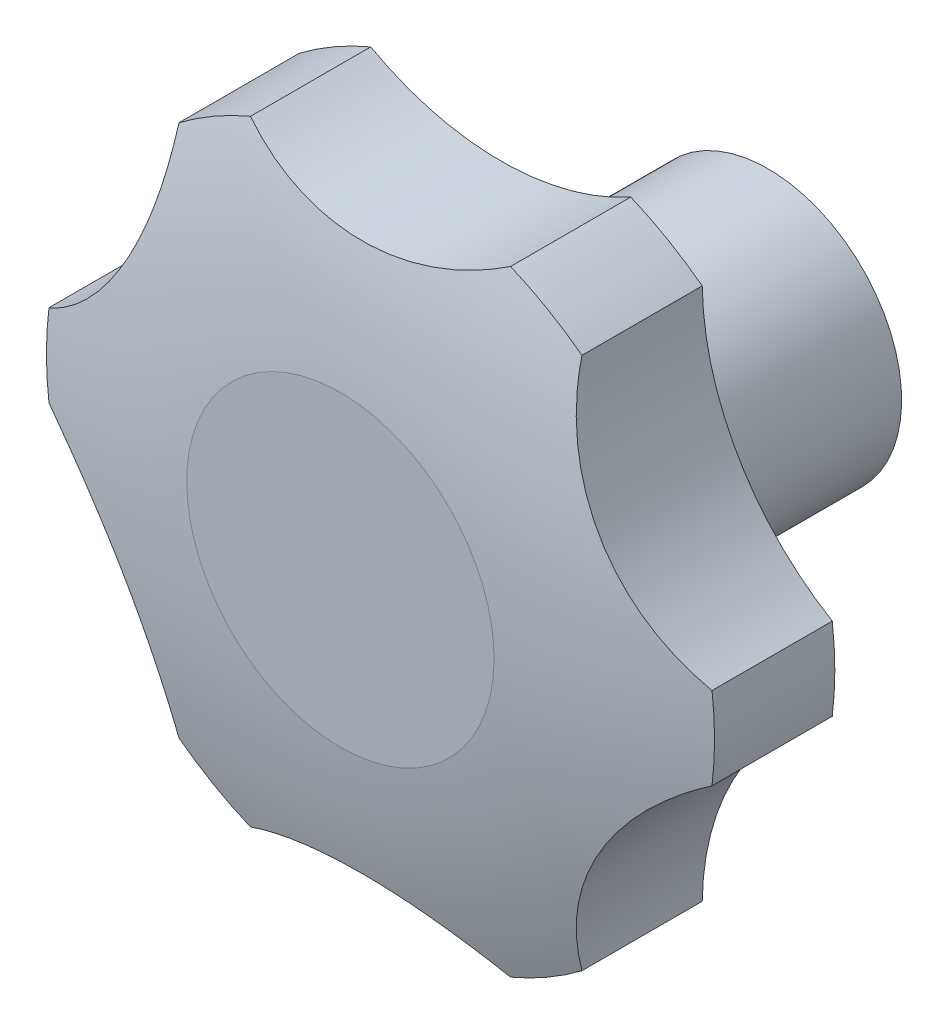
ISO-10303-21;
HEADER;
FILE_DESCRIPTION(('STEP AP214'),'2;1');
FILE_NAME('part.step','',(''),(''),'','','');
FILE_SCHEMA(('AUTOMOTIVE_DESIGN { 1 0 10303 214 1 1 1 1 }'));
ENDSEC;
DATA;
#1=APPLICATION_CONTEXT('core data for automotive mechanical design processes');
#2=APPLICATION_PROTOCOL_DEFINITION('international standard','automotive_design',2000,#1);
#3=PRODUCT_CONTEXT('',#1,'mechanical');
#4=PRODUCT('Part','Part','',(#3));
#5=PRODUCT_RELATED_PRODUCT_CATEGORY('part','',(#4));
#6=PRODUCT_DEFINITION_FORMATION('','',#4);
#7=PRODUCT_DEFINITION_CONTEXT('part definition',#1,'design');
#8=PRODUCT_DEFINITION('design','',#6,#7);
#9=PRODUCT_DEFINITION_SHAPE('','',#8);
#10=(LENGTH_UNIT() NAMED_UNIT(*) SI_UNIT(.MILLI.,.METRE.));
#11=(NAMED_UNIT(*) PLANE_ANGLE_UNIT() SI_UNIT($,.RADIAN.));
#12=(NAMED_UNIT(*) SI_UNIT($,.STERADIAN.) SOLID_ANGLE_UNIT());
#13=UNCERTAINTY_MEASURE_WITH_UNIT(LENGTH_MEASURE(1.E-05),#10,'distance_accuracy_value','');
#14=(GEOMETRIC_REPRESENTATION_CONTEXT(3) GLOBAL_UNCERTAINTY_ASSIGNED_CONTEXT((#13)) GLOBAL_UNIT_ASSIGNED_CONTEXT((#10,
#11,#12)) REPRESENTATION_CONTEXT('',''));
#15=CARTESIAN_POINT('',(0.,0.,0.));
#16=DIRECTION('',(0.,0.,1.));
#17=DIRECTION('',(1.,0.,0.));
#18=AXIS2_PLACEMENT_3D('',#15,#16,#17);
#19=CARTESIAN_POINT('',(0.,0.,30.));
#20=DIRECTION('',(0.,0.,1.));
#21=DIRECTION('',(0.,-1.,0.));
#22=AXIS2_PLACEMENT_3D('',#19,#20,#21);
#23=CYLINDRICAL_SURFACE('',#22,25.);
#24=DIRECTION('',(0.,0.,1.));
#25=VECTOR('',#24,1.);
#26=CARTESIAN_POINT('',(24.8088878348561,-3.0853013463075,24.5));
#27=LINE('',#26,#25);
#28=CARTESIAN_POINT('',(24.8088878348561,-3.0853013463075,20.));
#29=VERTEX_POINT('',#28);
#30=CARTESIAN_POINT('',(24.8088878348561,-3.0853013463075,29.));
#31=VERTEX_POINT('',#30);
#32=EDGE_CURVE('E35',#29,#31,#27,.T.);
#33=ORIENTED_EDGE('',*,*,#32,.F.);
#34=CARTESIAN_POINT('',(0.,0.,20.));
#35=DIRECTION('',(0.,0.,1.));
#36=DIRECTION('',(0.,-1.,0.));
#37=AXIS2_PLACEMENT_3D('',#34,#35,#36);
#38=CIRCLE('',#37,25.);
#39=CARTESIAN_POINT('',(24.8088878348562,3.08530134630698,20.));
#40=VERTEX_POINT('',#39);
#41=EDGE_CURVE('E120',#29,#40,#38,.T.);
#42=ORIENTED_EDGE('',*,*,#41,.T.);
#43=DIRECTION('',(0.,0.,1.));
#44=VECTOR('',#43,1.);
#45=CARTESIAN_POINT('',(24.8088878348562,3.08530134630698,26.));
#46=LINE('',#45,#44);
#47=CARTESIAN_POINT('',(24.8088878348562,3.08530134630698,29.));
#48=VERTEX_POINT('',#47);
#49=EDGE_CURVE('E296',#48,#40,#46,.F.);
#50=ORIENTED_EDGE('',*,*,#49,.F.);
#51=CARTESIAN_POINT('',(0.,0.,29.));
#52=DIRECTION('',(0.,0.,1.));
#53=DIRECTION('',(0.,-1.,0.));
#54=AXIS2_PLACEMENT_3D('',#51,#52,#53);
#55=CIRCLE('',#54,25.);
#56=EDGE_CURVE('E122',#31,#48,#55,.T.);
#57=ORIENTED_EDGE('',*,*,#56,.F.);
#58=EDGE_LOOP('',(#33,#42,#50,#57));
#59=FACE_BOUND('',#58,.T.);
#60=ADVANCED_FACE('F14',(#59),#23,.T.);
#61=DIRECTION('',(0.,0.,1.));
#62=VECTOR('',#61,1.);
#63=CARTESIAN_POINT('',(15.0763932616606,19.9424764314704,26.));
#64=LINE('',#63,#62);
#65=CARTESIAN_POINT('',(15.0763932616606,19.9424764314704,20.));
#66=VERTEX_POINT('',#65);
#67=CARTESIAN_POINT('',(15.0763932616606,19.9424764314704,29.));
#68=VERTEX_POINT('',#67);
#69=EDGE_CURVE('E42',#66,#68,#64,.T.);
#70=ORIENTED_EDGE('',*,*,#69,.F.);
#71=CARTESIAN_POINT('',(9.73249457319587,23.0277777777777,20.));
#72=VERTEX_POINT('',#71);
#73=EDGE_CURVE('E130',#66,#72,#38,.T.);
#74=ORIENTED_EDGE('',*,*,#73,.T.);
#75=DIRECTION('',(0.,0.,1.));
#76=VECTOR('',#75,1.);
#77=CARTESIAN_POINT('',(9.73249457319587,23.0277777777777,26.));
#78=LINE('',#77,#76);
#79=CARTESIAN_POINT('',(9.73249457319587,23.0277777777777,29.));
#80=VERTEX_POINT('',#79);
#81=EDGE_CURVE('E289',#80,#72,#78,.F.);
#82=ORIENTED_EDGE('',*,*,#81,.F.);
#83=EDGE_CURVE('E262',#68,#80,#55,.T.);
#84=ORIENTED_EDGE('',*,*,#83,.F.);
#85=EDGE_LOOP('',(#70,#74,#82,#84));
#86=FACE_BOUND('',#85,.T.);
#87=ADVANCED_FACE('F217',(#86),#23,.T.);
#88=DIRECTION('',(0.,0.,1.));
#89=VECTOR('',#88,1.);
#90=CARTESIAN_POINT('',(-9.73249457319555,23.0277777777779,26.));
#91=LINE('',#90,#89);
#92=CARTESIAN_POINT('',(-9.73249457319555,23.0277777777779,20.));
#93=VERTEX_POINT('',#92);
#94=CARTESIAN_POINT('',(-9.73249457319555,23.0277777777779,29.));
#95=VERTEX_POINT('',#94);
#96=EDGE_CURVE('E287',#93,#95,#91,.T.);
#97=ORIENTED_EDGE('',*,*,#96,.F.);
#98=CARTESIAN_POINT('',(-15.0763932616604,19.9424764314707,20.));
#99=VERTEX_POINT('',#98);
#100=EDGE_CURVE('E134',#93,#99,#38,.T.);
#101=ORIENTED_EDGE('',*,*,#100,.T.);
#102=DIRECTION('',(0.,0.,1.));
#103=VECTOR('',#102,1.);
#104=CARTESIAN_POINT('',(-15.0763932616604,19.9424764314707,26.));
#105=LINE('',#104,#103);
#106=CARTESIAN_POINT('',(-15.0763932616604,19.9424764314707,29.));
#107=VERTEX_POINT('',#106);
#108=EDGE_CURVE('E281',#107,#99,#105,.F.);
#109=ORIENTED_EDGE('',*,*,#108,.F.);
#110=EDGE_CURVE('E266',#95,#107,#55,.T.);
#111=ORIENTED_EDGE('',*,*,#110,.F.);
#112=EDGE_LOOP('',(#97,#101,#109,#111));
#113=FACE_BOUND('',#112,.T.);
#114=ADVANCED_FACE('F222',(#113),#23,.T.);
#115=DIRECTION('',(0.,0.,1.));
#116=VECTOR('',#115,1.);
#117=CARTESIAN_POINT('',(-24.8088878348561,3.08530134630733,26.));
#118=LINE('',#117,#116);
#119=CARTESIAN_POINT('',(-24.8088878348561,3.08530134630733,20.));
#120=VERTEX_POINT('',#119);
#121=CARTESIAN_POINT('',(-24.8088878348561,3.08530134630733,29.));
#122=VERTEX_POINT('',#121);
#123=EDGE_CURVE('E279',#120,#122,#118,.T.);
#124=ORIENTED_EDGE('',*,*,#123,.F.);
#125=CARTESIAN_POINT('',(-24.8088878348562,-3.08530134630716,20.));
#126=VERTEX_POINT('',#125);
#127=EDGE_CURVE('E258',#120,#126,#38,.T.);
#128=ORIENTED_EDGE('',*,*,#127,.T.);
#129=DIRECTION('',(0.,0.,1.));
#130=VECTOR('',#129,1.);
#131=CARTESIAN_POINT('',(-24.8088878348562,-3.08530134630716,24.5));
#132=LINE('',#131,#130);
#133=CARTESIAN_POINT('',(-24.8088878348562,-3.08530134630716,29.));
#134=VERTEX_POINT('',#133);
#135=EDGE_CURVE('E252',#134,#126,#132,.F.);
#136=ORIENTED_EDGE('',*,*,#135,.F.);
#137=EDGE_CURVE('E263',#122,#134,#55,.T.);
#138=ORIENTED_EDGE('',*,*,#137,.F.);
#139=EDGE_LOOP('',(#124,#128,#136,#138));
#140=FACE_BOUND('',#139,.T.);
#141=ADVANCED_FACE('F233',(#140),#23,.T.);
#142=DIRECTION('',(0.,0.,1.));
#143=VECTOR('',#142,1.);
#144=CARTESIAN_POINT('',(-15.0763932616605,-19.9424764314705,24.5));
#145=LINE('',#144,#143);
#146=CARTESIAN_POINT('',(-15.0763932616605,-19.9424764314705,20.));
#147=VERTEX_POINT('',#146);
#148=CARTESIAN_POINT('',(-15.0763932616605,-19.9424764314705,29.));
#149=VERTEX_POINT('',#148);
#150=EDGE_CURVE('E244',#147,#149,#145,.T.);
#151=ORIENTED_EDGE('',*,*,#150,.F.);
#152=CARTESIAN_POINT('',(-9.73249457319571,-23.0277777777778,20.));
#153=VERTEX_POINT('',#152);
#154=EDGE_CURVE('E133',#147,#153,#38,.T.);
#155=ORIENTED_EDGE('',*,*,#154,.T.);
#156=DIRECTION('',(0.,0.,1.));
#157=VECTOR('',#156,1.);
#158=CARTESIAN_POINT('',(-9.73249457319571,-23.0277777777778,24.5));
#159=LINE('',#158,#157);
#160=CARTESIAN_POINT('',(-9.73249457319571,-23.0277777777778,29.));
#161=VERTEX_POINT('',#160);
#162=EDGE_CURVE('E271',#161,#153,#159,.F.);
#163=ORIENTED_EDGE('',*,*,#162,.F.);
#164=EDGE_CURVE('E248',#149,#161,#55,.T.);
#165=ORIENTED_EDGE('',*,*,#164,.F.);
#166=EDGE_LOOP('',(#151,#155,#163,#165));
#167=FACE_BOUND('',#166,.T.);
#168=ADVANCED_FACE('F226',(#167),#23,.T.);
#169=CARTESIAN_POINT('',(0.,0.,0.));
#170=DIRECTION('',(0.,0.,1.));
#171=DIRECTION('',(0.,-1.,0.));
#172=AXIS2_PLACEMENT_3D('',#169,#170,#171);
#173=PLANE('',#172);
#174=CARTESIAN_POINT('',(0.,0.,0.));
#175=DIRECTION('',(0.,0.,-1.));
#176=DIRECTION('',(0.,1.,0.));
#177=AXIS2_PLACEMENT_3D('',#174,#175,#176);
#178=CIRCLE('',#177,2.5);
#179=CARTESIAN_POINT('',(0.,2.5,0.));
#180=VERTEX_POINT('',#179);
#181=EDGE_CURVE('E115',#180,#180,#178,.T.);
#182=ORIENTED_EDGE('',*,*,#181,.F.);
#183=EDGE_LOOP('',(#182));
#184=FACE_BOUND('',#183,.T.);
#185=CARTESIAN_POINT('',(0.,0.,0.));
#186=DIRECTION('',(0.,0.,1.));
#187=DIRECTION('',(0.,-1.,0.));
#188=AXIS2_PLACEMENT_3D('',#185,#186,#187);
#189=CIRCLE('',#188,10.);
#190=CARTESIAN_POINT('',(0.,-10.,0.));
#191=VERTEX_POINT('',#190);
#192=EDGE_CURVE('E141',#191,#191,#189,.T.);
#193=ORIENTED_EDGE('',*,*,#192,.F.);
#194=EDGE_LOOP('',(#193));
#195=FACE_BOUND('',#194,.T.);
#196=ADVANCED_FACE('F16',(#184,#195),#173,.F.);
#197=CARTESIAN_POINT('',(0.,0.,30.));
#198=DIRECTION('',(0.,0.,1.));
#199=DIRECTION('',(0.,-1.,0.));
#200=AXIS2_PLACEMENT_3D('',#197,#198,#199);
#201=CYLINDRICAL_SURFACE('',#200,10.);
#202=CARTESIAN_POINT('',(0.,0.,20.));
#203=DIRECTION('',(0.,0.,1.));
#204=DIRECTION('',(0.,-1.,0.));
#205=AXIS2_PLACEMENT_3D('',#202,#203,#204);
#206=CIRCLE('',#205,10.);
#207=CARTESIAN_POINT('',(0.,-10.,20.));
#208=VERTEX_POINT('',#207);
#209=EDGE_CURVE('E132',#208,#208,#206,.T.);
#210=ORIENTED_EDGE('',*,*,#209,.F.);
#211=EDGE_LOOP('',(#210));
#212=FACE_BOUND('',#211,.T.);
#213=ORIENTED_EDGE('',*,*,#192,.T.);
#214=EDGE_LOOP('',(#213));
#215=FACE_BOUND('',#214,.T.);
#216=ADVANCED_FACE('F231',(#212,#215),#201,.T.);
#217=CARTESIAN_POINT('',(10.,0.,20.));
#218=DIRECTION('',(0.,0.,1.));
#219=DIRECTION('',(0.,-1.,0.));
#220=AXIS2_PLACEMENT_3D('',#217,#218,#219);
#221=PLANE('',#220);
#222=ORIENTED_EDGE('',*,*,#41,.F.);
#223=CARTESIAN_POINT('',(35.0740288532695,-20.2500000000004,20.));
#224=DIRECTION('',(0.,0.,1.));
#225=DIRECTION('',(0.866025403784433,-0.50000000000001,0.));
#226=AXIS2_PLACEMENT_3D('',#223,#224,#225);
#227=CIRCLE('',#226,20.);
#228=CARTESIAN_POINT('',(15.0763932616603,-19.9424764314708,20.));
#229=VERTEX_POINT('',#228);
#230=EDGE_CURVE('E107',#29,#229,#227,.T.);
#231=ORIENTED_EDGE('',*,*,#230,.T.);
#232=CARTESIAN_POINT('',(9.73249457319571,-23.0277777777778,20.));
#233=VERTEX_POINT('',#232);
#234=EDGE_CURVE('E129',#233,#229,#38,.T.);
#235=ORIENTED_EDGE('',*,*,#234,.F.);
#236=CARTESIAN_POINT('',(0.,-40.5,20.));
#237=DIRECTION('',(0.,0.,1.));
#238=DIRECTION('',(0.,-1.,0.));
#239=AXIS2_PLACEMENT_3D('',#236,#237,#238);
#240=CIRCLE('',#239,20.);
#241=EDGE_CURVE('E251',#233,#153,#240,.T.);
#242=ORIENTED_EDGE('',*,*,#241,.T.);
#243=ORIENTED_EDGE('',*,*,#154,.F.);
#244=CARTESIAN_POINT('',(-35.0740288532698,-20.25,20.));
#245=DIRECTION('',(0.,0.,1.));
#246=DIRECTION('',(-0.86602540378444,-0.5,0.));
#247=AXIS2_PLACEMENT_3D('',#244,#245,#246);
#248=CIRCLE('',#247,20.);
#249=EDGE_CURVE('E257',#147,#126,#248,.T.);
#250=ORIENTED_EDGE('',*,*,#249,.T.);
#251=ORIENTED_EDGE('',*,*,#127,.F.);
#252=CARTESIAN_POINT('',(-35.0740288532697,20.25,20.));
#253=DIRECTION('',(0.,0.,1.));
#254=DIRECTION('',(-0.866025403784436,0.5,0.));
#255=AXIS2_PLACEMENT_3D('',#252,#253,#254);
#256=CIRCLE('',#255,20.);
#257=EDGE_CURVE('E284',#120,#99,#256,.T.);
#258=ORIENTED_EDGE('',*,*,#257,.T.);
#259=ORIENTED_EDGE('',*,*,#100,.F.);
#260=CARTESIAN_POINT('',(2.8281015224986E-13,40.5,20.));
#261=DIRECTION('',(0.,0.,1.));
#262=DIRECTION('',(0.,1.,0.));
#263=AXIS2_PLACEMENT_3D('',#260,#261,#262);
#264=CIRCLE('',#263,20.);
#265=EDGE_CURVE('E292',#93,#72,#264,.T.);
#266=ORIENTED_EDGE('',*,*,#265,.T.);
#267=ORIENTED_EDGE('',*,*,#73,.F.);
#268=CARTESIAN_POINT('',(35.07402885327,20.2499999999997,20.));
#269=DIRECTION('',(0.,0.,1.));
#270=DIRECTION('',(0.866025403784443,0.499999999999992,0.));
#271=AXIS2_PLACEMENT_3D('',#268,#269,#270);
#272=CIRCLE('',#271,20.);
#273=EDGE_CURVE('E123',#66,#40,#272,.T.);
#274=ORIENTED_EDGE('',*,*,#273,.T.);
#275=EDGE_LOOP('',(#222,#231,#235,#242,#243,#250,#251,#258,#259,#266,#267,#274));
#276=FACE_BOUND('',#275,.T.);
#277=ORIENTED_EDGE('',*,*,#209,.T.);
#278=EDGE_LOOP('',(#277));
#279=FACE_BOUND('',#278,.T.);
#280=ADVANCED_FACE('F126',(#276,#279),#221,.F.);
#281=DIRECTION('',(0.,0.,1.));
#282=VECTOR('',#281,1.);
#283=CARTESIAN_POINT('',(15.0763932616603,-19.9424764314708,24.5));
#284=LINE('',#283,#282);
#285=CARTESIAN_POINT('',(15.0763932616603,-19.9424764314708,29.));
#286=VERTEX_POINT('',#285);
#287=EDGE_CURVE('E110',#286,#229,#284,.F.);
#288=ORIENTED_EDGE('',*,*,#287,.F.);
#289=CARTESIAN_POINT('',(9.73249457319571,-23.0277777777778,29.));
#290=VERTEX_POINT('',#289);
#291=EDGE_CURVE('E137',#290,#286,#55,.T.);
#292=ORIENTED_EDGE('',*,*,#291,.F.);
#293=DIRECTION('',(0.,0.,1.));
#294=VECTOR('',#293,1.);
#295=CARTESIAN_POINT('',(9.73249457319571,-23.0277777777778,24.5));
#296=LINE('',#295,#294);
#297=EDGE_CURVE('E268',#233,#290,#296,.T.);
#298=ORIENTED_EDGE('',*,*,#297,.F.);
#299=ORIENTED_EDGE('',*,*,#234,.T.);
#300=EDGE_LOOP('',(#288,#292,#298,#299));
#301=FACE_BOUND('',#300,.T.);
#302=ADVANCED_FACE('F167',(#301),#23,.T.);
#303=CARTESIAN_POINT('',(0.,0.,-27.6809739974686));
#304=DIRECTION('',(0.,0.,1.));
#305=DIRECTION('',(0.,-1.,0.));
#306=AXIS2_PLACEMENT_3D('',#303,#304,#305);
#307=DEGENERATE_TOROIDAL_SURFACE('',#306,5.32089466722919,60.,.T.);
#308=CARTESIAN_POINT('',(0.,0.,32.));
#309=DIRECTION('',(0.,0.,1.));
#310=DIRECTION('',(0.,-1.,0.));
#311=AXIS2_PLACEMENT_3D('',#308,#309,#310);
#312=CIRCLE('',#311,11.5);
#313=CARTESIAN_POINT('',(0.,-11.5,32.));
#314=VERTEX_POINT('',#313);
#315=EDGE_CURVE('E264',#314,#314,#312,.T.);
#316=ORIENTED_EDGE('',*,*,#315,.F.);
#317=EDGE_LOOP('',(#316));
#318=FACE_BOUND('',#317,.T.);
#319=ORIENTED_EDGE('',*,*,#291,.T.);
#320=CARTESIAN_POINT('',(15.0763820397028,-19.9432070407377,28.9997999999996));
#321=CARTESIAN_POINT('',(15.0804305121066,-19.679248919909,29.072060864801));
#322=CARTESIAN_POINT('',(15.0897195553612,-19.4146501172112,29.1415656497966));
#323=CARTESIAN_POINT('',(15.1189241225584,-18.8846211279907,29.2749943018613));
#324=CARTESIAN_POINT('',(15.1388401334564,-18.6191909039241,29.3389179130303));
#325=CARTESIAN_POINT('',(15.2147453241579,-17.8223651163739,29.5222041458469));
#326=CARTESIAN_POINT('',(15.2868916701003,-17.2904338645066,29.6330823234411));
#327=CARTESIAN_POINT('',(15.4747228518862,-16.2304477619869,29.8315913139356));
#328=CARTESIAN_POINT('',(15.5903728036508,-15.7023901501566,29.9192406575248));
#329=CARTESIAN_POINT('',(15.8651269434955,-14.6543382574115,30.0712245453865));
#330=CARTESIAN_POINT('',(16.0242235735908,-14.1343425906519,30.1355631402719));
#331=CARTESIAN_POINT('',(16.3742261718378,-13.1381037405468,30.237736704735));
#332=CARTESIAN_POINT('',(16.5626240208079,-12.6611173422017,30.2769401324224));
#333=CARTESIAN_POINT('',(16.9760658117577,-11.7219913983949,30.3348364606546));
#334=CARTESIAN_POINT('',(17.201110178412,-11.2598520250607,30.353529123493));
#335=CARTESIAN_POINT('',(17.686194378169,-10.3541932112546,30.3704472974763));
#336=CARTESIAN_POINT('',(17.9462188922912,-9.91066573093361,30.3686817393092));
#337=CARTESIAN_POINT('',(18.4993592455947,-9.04535898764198,30.3447003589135));
#338=CARTESIAN_POINT('',(18.792473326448,-8.62357857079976,30.322485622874));
#339=CARTESIAN_POINT('',(19.4013944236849,-7.81545884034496,30.2583977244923));
#340=CARTESIAN_POINT('',(19.7164129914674,-7.42848307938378,30.217050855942));
#341=CARTESIAN_POINT('',(20.3731022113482,-6.68053318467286,30.1148502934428));
#342=CARTESIAN_POINT('',(20.7147753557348,-6.31956148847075,30.0539947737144));
#343=CARTESIAN_POINT('',(21.4216122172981,-5.62616849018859,29.9128619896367));
#344=CARTESIAN_POINT('',(21.7867555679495,-5.29372300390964,29.8326014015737));
#345=CARTESIAN_POINT('',(22.5376440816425,-4.65895821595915,29.6528086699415));
#346=CARTESIAN_POINT('',(22.9233800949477,-4.35662570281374,29.5532850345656));
#347=CARTESIAN_POINT('',(23.5605586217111,-3.89365258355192,29.3772343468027));
#348=CARTESIAN_POINT('',(23.8065957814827,-3.72323612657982,29.3065832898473));
#349=CARTESIAN_POINT('',(24.3040728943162,-3.39483036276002,29.1583668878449));
#350=CARTESIAN_POINT('',(24.5555013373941,-3.23681739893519,29.0808153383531));
#351=CARTESIAN_POINT('',(24.8095149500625,-3.0849263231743,28.9998));
#352=B_SPLINE_CURVE_WITH_KNOTS('',3,(#320,#321,#322,#323,#324,#325,#326,#327,#328,#329,#330,
#331,#332,#333,#334,#335,#336,#337,#338,#339,#340,#341,#342,#343,#344,#345,#346,#347,#348,#349,
#350,#351),.UNSPECIFIED.,.F.,.F.,(4,2,2,2,2,2,2,2,2,2,2,2,2,2,2,4),(0.,0.820968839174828,
1.64197530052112,3.28398644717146,4.92468371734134,6.56509575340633,8.10622043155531,
9.64736297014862,11.1878327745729,12.7282207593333,14.228546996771,15.7290136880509,
17.2281954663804,18.7267165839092,19.6489280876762,20.5693356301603),.UNSPECIFIED.);
#353=EDGE_CURVE('E9',#286,#31,#352,.T.);
#354=ORIENTED_EDGE('',*,*,#353,.T.);
#355=ORIENTED_EDGE('',*,*,#56,.T.);
#356=CARTESIAN_POINT('',(24.8095149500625,3.08492632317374,28.9998));
#357=CARTESIAN_POINT('',(24.5829447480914,3.22041146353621,29.0720608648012));
#358=CARTESIAN_POINT('',(24.3584399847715,3.36075541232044,29.1415656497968));
#359=CARTESIAN_POINT('',(23.9140236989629,3.65106180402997,29.2749943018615));
#360=CARTESIAN_POINT('',(23.6941123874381,3.80102468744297,29.3389179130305));
#361=CARTESIAN_POINT('',(23.0419936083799,4.26517340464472,29.5222041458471));
#362=CARTESIAN_POINT('',(22.6174008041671,4.59361959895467,29.6330823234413));
#363=CARTESIAN_POINT('',(21.7933415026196,5.286279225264,29.8315913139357));
#364=CARTESIAN_POINT('',(21.3938551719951,5.65046382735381,29.9192406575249));
#365=CARTESIAN_POINT('',(20.6235926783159,6.41243383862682,30.0712245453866));
#366=CARTESIAN_POINT('',(20.2528115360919,6.81021339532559,30.1355631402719));
#367=CARTESIAN_POINT('',(19.5650446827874,7.61144396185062,30.2377367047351));
#368=CARTESIAN_POINT('',(19.246161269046,8.01309448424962,30.2769401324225));
#369=CARTESIAN_POINT('',(18.6395752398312,8.8407085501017,30.3348364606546));
#370=CARTESIAN_POINT('',(18.3518729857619,9.26667237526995,30.353529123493));
#371=CARTESIAN_POINT('',(17.8100915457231,10.139597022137,30.3704472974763));
#372=CARTESIAN_POINT('',(17.5559977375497,10.5865485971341,30.3686817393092));
#373=CARTESIAN_POINT('',(17.083190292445,11.498235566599,30.3447003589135));
#374=CARTESIAN_POINT('',(16.8644747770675,11.962970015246,30.322485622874));
#375=CARTESIAN_POINT('',(16.4690831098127,12.8943710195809,30.2583977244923));
#376=CARTESIAN_POINT('',(16.2914615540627,13.3606729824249,30.217050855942));
#377=CARTESIAN_POINT('',(15.9720625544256,14.3033574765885,30.1148502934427));
#378=CARTESIAN_POINT('',(15.8302884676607,14.7797409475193,30.0539947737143));
#379=CARTESIAN_POINT('',(15.5832109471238,15.7385761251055,29.9128619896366));
#380=CARTESIAN_POINT('',(15.4778763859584,16.221022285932,29.8326014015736));
#381=CARTESIAN_POINT('',(15.303598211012,17.1886932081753,29.6528086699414));
#382=CARTESIAN_POINT('',(15.2346385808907,17.6739166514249,29.5532850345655));
#383=CARTESIAN_POINT('',(15.1522813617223,18.4572160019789,29.3772343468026));
#384=CARTESIAN_POINT('',(15.1277149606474,18.7554986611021,29.3065832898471));
#385=CARTESIAN_POINT('',(15.0920457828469,19.3505293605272,29.1583668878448));
#386=CARTESIAN_POINT('',(15.0809167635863,19.6472792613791,29.080815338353));
#387=CARTESIAN_POINT('',(15.0763820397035,19.9432070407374,28.9998));
#388=B_SPLINE_CURVE_WITH_KNOTS('',3,(#356,#357,#358,#359,#360,#361,#362,#363,#364,#365,#366,
#367,#368,#369,#370,#371,#372,#373,#374,#375,#376,#377,#378,#379,#380,#381,#382,#383,#384,#385,
#386,#387),.UNSPECIFIED.,.F.,.F.,(4,2,2,2,2,2,2,2,2,2,2,2,2,2,2,4),(0.,0.820968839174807,
1.64197530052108,3.28398644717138,4.92468371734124,6.5650957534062,8.10622043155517,
9.64736297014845,11.1878327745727,12.7282207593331,14.2285469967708,15.7290136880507,
17.2281954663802,18.726716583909,19.648928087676,20.5693356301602),.UNSPECIFIED.);
#389=EDGE_CURVE('E28',#48,#68,#388,.T.);
#390=ORIENTED_EDGE('',*,*,#389,.T.);
#391=ORIENTED_EDGE('',*,*,#83,.T.);
#392=CARTESIAN_POINT('',(-16.7108503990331,29.5114842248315,25.0676446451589));
#393=CARTESIAN_POINT('',(-16.4186475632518,29.0670277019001,25.3553824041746));
#394=CARTESIAN_POINT('',(-16.105962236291,28.6302220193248,25.6345035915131));
#395=CARTESIAN_POINT('',(-15.4398548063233,27.7758472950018,26.1739035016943));
#396=CARTESIAN_POINT('',(-15.0864012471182,27.3582934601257,26.4341674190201));
#397=CARTESIAN_POINT('',(-14.3375649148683,26.5450236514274,26.9350456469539));
#398=CARTESIAN_POINT('',(-13.9419804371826,26.1494279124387,27.175554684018));
#399=CARTESIAN_POINT('',(-13.1117458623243,25.3871049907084,27.6335565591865));
#400=CARTESIAN_POINT('',(-12.6771053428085,25.0203707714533,27.8510550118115));
#401=CARTESIAN_POINT('',(-11.7690736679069,24.3191754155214,28.2620953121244));
#402=CARTESIAN_POINT('',(-11.2955504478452,23.9848334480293,28.4555493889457));
#403=CARTESIAN_POINT('',(-10.3139448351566,23.3546598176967,28.8160605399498));
#404=CARTESIAN_POINT('',(-9.80585929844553,23.0588316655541,28.9831152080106));
#405=CARTESIAN_POINT('',(-8.76040847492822,22.5110440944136,29.2891374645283));
#406=CARTESIAN_POINT('',(-8.22312818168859,22.2589654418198,29.4281815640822));
#407=CARTESIAN_POINT('',(-7.1226446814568,21.8017972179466,29.6778981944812));
#408=CARTESIAN_POINT('',(-6.55944576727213,21.5966998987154,29.7885754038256));
#409=CARTESIAN_POINT('',(-5.48629709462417,21.2600697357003,29.9687419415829));
#410=CARTESIAN_POINT('',(-4.9788217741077,21.1224665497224,30.0416987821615));
#411=CARTESIAN_POINT('',(-3.95206910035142,20.8872886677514,30.1656891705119));
#412=CARTESIAN_POINT('',(-3.43279276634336,20.7897105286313,30.2167246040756));
#413=CARTESIAN_POINT('',(-2.3861942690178,20.6358104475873,30.2969383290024));
#414=CARTESIAN_POINT('',(-1.85886768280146,20.5795120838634,30.3261041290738));
#415=CARTESIAN_POINT('',(-0.800654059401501,20.5089990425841,30.3626008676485));
#416=CARTESIAN_POINT('',(-0.269767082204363,20.4947836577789,30.3699321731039));
#417=CARTESIAN_POINT('',(0.763001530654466,20.5082475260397,30.3629752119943));
#418=CARTESIAN_POINT('',(1.26492110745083,20.5337343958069,30.3498183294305));
#419=CARTESIAN_POINT('',(2.26451398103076,20.6222812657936,30.3039230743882));
#420=CARTESIAN_POINT('',(2.76218748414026,20.6853394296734,30.2711856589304));
#421=CARTESIAN_POINT('',(3.74934802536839,20.8482203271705,30.1861060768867));
#422=CARTESIAN_POINT('',(4.23884150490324,20.9480125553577,30.1337801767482));
#423=CARTESIAN_POINT('',(5.20665138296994,21.183199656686,30.0095001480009));
#424=CARTESIAN_POINT('',(5.6849677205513,21.3185947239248,29.9375459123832));
#425=CARTESIAN_POINT('',(6.62671442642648,21.6232591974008,29.774179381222));
#426=CARTESIAN_POINT('',(7.09015929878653,21.7924943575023,29.6827867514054));
#427=CARTESIAN_POINT('',(7.99971028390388,22.1629940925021,29.4807482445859));
#428=CARTESIAN_POINT('',(8.44581628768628,22.3642588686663,29.3701022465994));
#429=CARTESIAN_POINT('',(9.31865489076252,22.7968856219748,29.1298258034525));
#430=CARTESIAN_POINT('',(9.74536001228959,23.0282885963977,29.0001694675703));
#431=CARTESIAN_POINT('',(10.5764635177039,23.5185041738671,28.7226105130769));
#432=CARTESIAN_POINT('',(10.9808623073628,23.7773162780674,28.5747082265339));
#433=CARTESIAN_POINT('',(11.7826651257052,24.3316172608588,28.2545778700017));
#434=CARTESIAN_POINT('',(12.1789902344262,24.6282149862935,28.0815689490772));
#435=CARTESIAN_POINT('',(12.9437391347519,25.2454542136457,27.7175133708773));
#436=CARTESIAN_POINT('',(13.3121574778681,25.5661003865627,27.5264632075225));
#437=CARTESIAN_POINT('',(14.0189099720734,26.2275175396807,27.1279772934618));
#438=CARTESIAN_POINT('',(14.3573170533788,26.568236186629,26.9205837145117));
#439=CARTESIAN_POINT('',(15.0041997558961,27.2674244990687,26.4902822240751));
#440=CARTESIAN_POINT('',(15.3126912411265,27.6258846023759,26.2673826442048));
#441=CARTESIAN_POINT('',(15.6059669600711,27.9918508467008,26.0372614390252));
#442=B_SPLINE_CURVE_WITH_KNOTS('',3,(#392,#393,#394,#395,#396,#397,#398,#399,#400,#401,#402,
#403,#404,#405,#406,#407,#408,#409,#410,#411,#412,#413,#414,#415,#416,#417,#418,#419,#420,#421,
#422,#423,#424,#425,#426,#427,#428,#429,#430,#431,#432,#433,#434,#435,#436,#437,#438,#439,#440,
#441),.UNSPECIFIED.,.F.,.F.,(4,2,2,2,2,2,2,2,2,2,2,2,2,2,2,2,2,2,2,2,2,2,2,2,4),(0.,
1.81404362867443,3.62949643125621,5.45406882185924,7.27819498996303,9.10879565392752,
10.9395630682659,12.7652598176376,14.5906552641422,16.1811431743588,17.7714942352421,
19.3627529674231,20.9539849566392,22.4604128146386,23.9667670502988,25.471873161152,
26.9769874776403,28.4805862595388,29.9841944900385,31.4898698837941,32.9955178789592,
34.5669972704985,36.1387826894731,37.7066374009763,39.2736560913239),.UNSPECIFIED.);
#443=EDGE_CURVE('E182',#80,#95,#442,.F.);
#444=ORIENTED_EDGE('',*,*,#443,.T.);
#445=ORIENTED_EDGE('',*,*,#110,.T.);
#446=CARTESIAN_POINT('',(-15.0763820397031,19.9432070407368,28.9998));
#447=CARTESIAN_POINT('',(-15.0804305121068,19.679248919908,29.0720608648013));
#448=CARTESIAN_POINT('',(-15.0897195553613,19.4146501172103,29.1415656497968));
#449=CARTESIAN_POINT('',(-15.1189241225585,18.8846211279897,29.2749943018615));
#450=CARTESIAN_POINT('',(-15.1388401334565,18.6191909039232,29.3389179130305));
#451=CARTESIAN_POINT('',(-15.2147453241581,17.822365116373,29.5222041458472));
#452=CARTESIAN_POINT('',(-15.2868916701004,17.2904338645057,29.6330823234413));
#453=CARTESIAN_POINT('',(-15.4747228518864,16.230447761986,29.8315913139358));
#454=CARTESIAN_POINT('',(-15.590372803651,15.7023901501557,29.919240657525));
#455=CARTESIAN_POINT('',(-15.8651269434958,14.6543382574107,30.0712245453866));
#456=CARTESIAN_POINT('',(-16.0242235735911,14.1343425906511,30.1355631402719));
#457=CARTESIAN_POINT('',(-16.3742261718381,13.138103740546,30.2377367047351));
#458=CARTESIAN_POINT('',(-16.5626240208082,12.6611173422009,30.2769401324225));
#459=CARTESIAN_POINT('',(-16.976065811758,11.7219913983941,30.3348364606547));
#460=CARTESIAN_POINT('',(-17.2011101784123,11.25985202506,30.3535291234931));
#461=CARTESIAN_POINT('',(-17.6861943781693,10.3541932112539,30.3704472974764));
#462=CARTESIAN_POINT('',(-17.9462188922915,9.91066573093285,30.3686817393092));
#463=CARTESIAN_POINT('',(-18.4993592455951,9.04535898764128,30.3447003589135));
#464=CARTESIAN_POINT('',(-18.7924733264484,8.62357857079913,30.3224856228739));
#465=CARTESIAN_POINT('',(-19.4013944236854,7.81545884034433,30.2583977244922));
#466=CARTESIAN_POINT('',(-19.7164129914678,7.42848307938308,30.217050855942));
#467=CARTESIAN_POINT('',(-20.3731022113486,6.68053318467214,30.1148502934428));
#468=CARTESIAN_POINT('',(-20.7147753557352,6.31956148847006,30.0539947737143));
#469=CARTESIAN_POINT('',(-21.4216122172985,5.62616849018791,29.9128619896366));
#470=CARTESIAN_POINT('',(-21.7867555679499,5.29372300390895,29.8326014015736));
#471=CARTESIAN_POINT('',(-22.5376440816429,4.65895821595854,29.6528086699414));
#472=CARTESIAN_POINT('',(-22.9233800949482,4.35662570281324,29.5532850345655));
#473=CARTESIAN_POINT('',(-23.5605586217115,3.89365258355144,29.3772343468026));
#474=CARTESIAN_POINT('',(-23.806595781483,3.72323612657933,29.3065832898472));
#475=CARTESIAN_POINT('',(-24.3040728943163,3.39483036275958,29.1583668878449));
#476=CARTESIAN_POINT('',(-24.5555013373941,3.23681739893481,29.0808153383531));
#477=CARTESIAN_POINT('',(-24.8095149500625,3.08492632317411,28.9998));
#478=B_SPLINE_CURVE_WITH_KNOTS('',3,(#446,#447,#448,#449,#450,#451,#452,#453,#454,#455,#456,
#457,#458,#459,#460,#461,#462,#463,#464,#465,#466,#467,#468,#469,#470,#471,#472,#473,#474,#475,
#476,#477),.UNSPECIFIED.,.F.,.F.,(4,2,2,2,2,2,2,2,2,2,2,2,2,2,2,4),(0.,0.820968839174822,
1.64197530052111,3.2839864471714,4.92468371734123,6.56509575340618,8.10622043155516,
9.64736297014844,11.1878327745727,12.7282207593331,14.2285469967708,15.7290136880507,
17.2281954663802,18.726716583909,19.6489280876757,20.5693356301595),.UNSPECIFIED.);
#479=EDGE_CURVE('E175',#107,#122,#478,.T.);
#480=ORIENTED_EDGE('',*,*,#479,.T.);
#481=ORIENTED_EDGE('',*,*,#137,.T.);
#482=CARTESIAN_POINT('',(-24.8095149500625,-3.08492632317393,28.9998));
#483=CARTESIAN_POINT('',(-24.5829447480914,-3.22041146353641,29.0720608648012));
#484=CARTESIAN_POINT('',(-24.3584399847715,-3.36075541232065,29.1415656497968));
#485=CARTESIAN_POINT('',(-23.9140236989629,-3.65106180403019,29.2749943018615));
#486=CARTESIAN_POINT('',(-23.6941123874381,-3.80102468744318,29.3389179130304));
#487=CARTESIAN_POINT('',(-23.0419936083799,-4.26517340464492,29.5222041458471));
#488=CARTESIAN_POINT('',(-22.6174008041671,-4.59361959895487,29.6330823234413));
#489=CARTESIAN_POINT('',(-21.7933415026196,-5.2862792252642,29.8315913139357));
#490=CARTESIAN_POINT('',(-21.3938551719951,-5.650463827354,29.9192406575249));
#491=CARTESIAN_POINT('',(-20.6235926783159,-6.41243383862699,30.0712245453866));
#492=CARTESIAN_POINT('',(-20.2528115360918,-6.81021339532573,30.1355631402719));
#493=CARTESIAN_POINT('',(-19.5650446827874,-7.61144396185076,30.2377367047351));
#494=CARTESIAN_POINT('',(-19.246161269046,-8.01309448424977,30.2769401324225));
#495=CARTESIAN_POINT('',(-18.6395752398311,-8.84070855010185,30.3348364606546));
#496=CARTESIAN_POINT('',(-18.3518729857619,-9.2666723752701,30.353529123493));
#497=CARTESIAN_POINT('',(-17.810091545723,-10.1395970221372,30.3704472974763));
#498=CARTESIAN_POINT('',(-17.5559977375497,-10.5865485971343,30.3686817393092));
#499=CARTESIAN_POINT('',(-17.0831902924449,-11.4982355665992,30.3447003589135));
#500=CARTESIAN_POINT('',(-16.8644747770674,-11.9629700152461,30.322485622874));
#501=CARTESIAN_POINT('',(-16.4690831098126,-12.894371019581,30.2583977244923));
#502=CARTESIAN_POINT('',(-16.2914615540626,-13.360672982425,30.217050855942));
#503=CARTESIAN_POINT('',(-15.9720625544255,-14.3033574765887,30.1148502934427));
#504=CARTESIAN_POINT('',(-15.8302884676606,-14.7797409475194,30.0539947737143));
#505=CARTESIAN_POINT('',(-15.5832109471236,-15.7385761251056,29.9128619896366));
#506=CARTESIAN_POINT('',(-15.4778763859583,-16.2210222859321,29.8326014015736));
#507=CARTESIAN_POINT('',(-15.3035982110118,-17.1886932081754,29.6528086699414));
#508=CARTESIAN_POINT('',(-15.2346385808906,-17.673916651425,29.5532850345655));
#509=CARTESIAN_POINT('',(-15.1522813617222,-18.457216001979,29.3772343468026));
#510=CARTESIAN_POINT('',(-15.1277149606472,-18.7554986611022,29.3065832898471));
#511=CARTESIAN_POINT('',(-15.0920457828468,-19.3505293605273,29.1583668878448));
#512=CARTESIAN_POINT('',(-15.0809167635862,-19.6472792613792,29.080815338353));
#513=CARTESIAN_POINT('',(-15.0763820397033,-19.9432070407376,28.9998));
#514=B_SPLINE_CURVE_WITH_KNOTS('',3,(#482,#483,#484,#485,#486,#487,#488,#489,#490,#491,#492,
#493,#494,#495,#496,#497,#498,#499,#500,#501,#502,#503,#504,#505,#506,#507,#508,#509,#510,#511,
#512,#513),.UNSPECIFIED.,.F.,.F.,(4,2,2,2,2,2,2,2,2,2,2,2,2,2,2,4),(0.,0.8209688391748,
1.64197530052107,3.28398644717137,4.92468371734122,6.56509575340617,8.10622043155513,
9.64736297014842,11.1878327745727,12.728220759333,14.2285469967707,15.7290136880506,
17.2281954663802,18.726716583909,19.648928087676,20.5693356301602),.UNSPECIFIED.);
#515=EDGE_CURVE('E152',#134,#149,#514,.T.);
#516=ORIENTED_EDGE('',*,*,#515,.T.);
#517=ORIENTED_EDGE('',*,*,#164,.T.);
#518=CARTESIAN_POINT('',(16.7108503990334,-29.5114842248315,25.0676446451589));
#519=CARTESIAN_POINT('',(16.4186475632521,-29.0670277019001,25.3553824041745));
#520=CARTESIAN_POINT('',(16.1059622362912,-28.6302220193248,25.634503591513));
#521=CARTESIAN_POINT('',(15.4398548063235,-27.7758472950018,26.1739035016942));
#522=CARTESIAN_POINT('',(15.0864012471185,-27.3582934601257,26.43416741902));
#523=CARTESIAN_POINT('',(14.3375649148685,-26.5450236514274,26.9350456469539));
#524=CARTESIAN_POINT('',(13.9419804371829,-26.1494279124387,27.175554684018));
#525=CARTESIAN_POINT('',(13.1117458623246,-25.3871049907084,27.6335565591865));
#526=CARTESIAN_POINT('',(12.6771053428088,-25.0203707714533,27.8510550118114));
#527=CARTESIAN_POINT('',(11.7690736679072,-24.3191754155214,28.2620953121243));
#528=CARTESIAN_POINT('',(11.2955504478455,-23.9848334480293,28.4555493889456));
#529=CARTESIAN_POINT('',(10.3139448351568,-23.3546598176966,28.8160605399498));
#530=CARTESIAN_POINT('',(9.8058592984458,-23.0588316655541,28.9831152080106));
#531=CARTESIAN_POINT('',(8.76040847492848,-22.5110440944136,29.2891374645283));
#532=CARTESIAN_POINT('',(8.22312818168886,-22.2589654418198,29.4281815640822));
#533=CARTESIAN_POINT('',(7.12264468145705,-21.8017972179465,29.6778981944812));
#534=CARTESIAN_POINT('',(6.55944576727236,-21.5966998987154,29.7885754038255));
#535=CARTESIAN_POINT('',(5.4862970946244,-21.2600697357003,29.9687419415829));
#536=CARTESIAN_POINT('',(4.97882177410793,-21.1224665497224,30.0416987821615));
#537=CARTESIAN_POINT('',(3.95206910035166,-20.8872886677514,30.1656891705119));
#538=CARTESIAN_POINT('',(3.4327927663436,-20.7897105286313,30.2167246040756));
#539=CARTESIAN_POINT('',(2.38619426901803,-20.6358104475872,30.2969383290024));
#540=CARTESIAN_POINT('',(1.85886768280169,-20.5795120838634,30.3261041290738));
#541=CARTESIAN_POINT('',(0.80065405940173,-20.5089990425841,30.3626008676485));
#542=CARTESIAN_POINT('',(0.26976708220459,-20.4947836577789,30.3699321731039));
#543=CARTESIAN_POINT('',(-0.763001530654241,-20.5082475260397,30.3629752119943));
#544=CARTESIAN_POINT('',(-1.2649211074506,-20.5337343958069,30.3498183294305));
#545=CARTESIAN_POINT('',(-2.26451398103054,-20.6222812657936,30.3039230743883));
#546=CARTESIAN_POINT('',(-2.76218748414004,-20.6853394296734,30.2711856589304));
#547=CARTESIAN_POINT('',(-3.74934802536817,-20.8482203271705,30.1861060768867));
#548=CARTESIAN_POINT('',(-4.23884150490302,-20.9480125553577,30.1337801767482));
#549=CARTESIAN_POINT('',(-5.20665138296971,-21.183199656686,30.0095001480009));
#550=CARTESIAN_POINT('',(-5.68496772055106,-21.3185947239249,29.9375459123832));
#551=CARTESIAN_POINT('',(-6.62671442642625,-21.6232591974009,29.774179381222));
#552=CARTESIAN_POINT('',(-7.09015929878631,-21.7924943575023,29.6827867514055));
#553=CARTESIAN_POINT('',(-7.99971028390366,-22.1629940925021,29.480748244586));
#554=CARTESIAN_POINT('',(-8.44581628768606,-22.3642588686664,29.3701022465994));
#555=CARTESIAN_POINT('',(-9.3186548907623,-22.7968856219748,29.1298258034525));
#556=CARTESIAN_POINT('',(-9.74536001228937,-23.0282885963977,29.0001694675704));
#557=CARTESIAN_POINT('',(-10.5764635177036,-23.5185041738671,28.7226105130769));
#558=CARTESIAN_POINT('',(-10.9808623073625,-23.7773162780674,28.5747082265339));
#559=CARTESIAN_POINT('',(-11.782665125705,-24.3316172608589,28.2545778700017));
#560=CARTESIAN_POINT('',(-12.1789902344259,-24.6282149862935,28.0815689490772));
#561=CARTESIAN_POINT('',(-12.9437391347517,-25.2454542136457,27.7175133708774));
#562=CARTESIAN_POINT('',(-13.3121574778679,-25.5661003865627,27.5264632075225));
#563=CARTESIAN_POINT('',(-14.0189099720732,-26.2275175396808,27.1279772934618));
#564=CARTESIAN_POINT('',(-14.3573170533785,-26.5682361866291,26.9205837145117));
#565=CARTESIAN_POINT('',(-15.0041997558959,-27.2674244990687,26.4902822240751));
#566=CARTESIAN_POINT('',(-15.3126912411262,-27.6258846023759,26.2673826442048));
#567=CARTESIAN_POINT('',(-15.6059669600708,-27.9918508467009,26.0372614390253));
#568=B_SPLINE_CURVE_WITH_KNOTS('',3,(#518,#519,#520,#521,#522,#523,#524,#525,#526,#527,#528,
#529,#530,#531,#532,#533,#534,#535,#536,#537,#538,#539,#540,#541,#542,#543,#544,#545,#546,#547,
#548,#549,#550,#551,#552,#553,#554,#555,#556,#557,#558,#559,#560,#561,#562,#563,#564,#565,#566,
#567),.UNSPECIFIED.,.F.,.F.,(4,2,2,2,2,2,2,2,2,2,2,2,2,2,2,2,2,2,2,2,2,2,2,2,4),(0.,
1.81404362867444,3.62949643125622,5.45406882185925,7.27819498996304,9.10879565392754,
10.939563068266,12.7652598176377,14.5906552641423,16.1811431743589,17.7714942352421,
19.3627529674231,20.9539849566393,22.4604128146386,23.9667670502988,25.4718731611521,
26.9769874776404,28.4805862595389,29.9841944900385,31.4898698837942,32.9955178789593,
34.5669972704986,36.1387826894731,37.7066374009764,39.273656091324),.UNSPECIFIED.);
#569=EDGE_CURVE('E144',#161,#290,#568,.F.);
#570=ORIENTED_EDGE('',*,*,#569,.T.);
#571=EDGE_LOOP('',(#319,#354,#355,#390,#391,#444,#445,#480,#481,#516,#517,#570));
#572=FACE_BOUND('',#571,.T.);
#573=ADVANCED_FACE('F162',(#318,#572),#307,.T.);
#574=CARTESIAN_POINT('',(0.,0.,32.));
#575=DIRECTION('',(0.,0.,1.));
#576=DIRECTION('',(0.,-1.,0.));
#577=AXIS2_PLACEMENT_3D('',#574,#575,#576);
#578=PLANE('',#577);
#579=ORIENTED_EDGE('',*,*,#315,.T.);
#580=EDGE_LOOP('',(#579));
#581=FACE_BOUND('',#580,.T.);
#582=ADVANCED_FACE('F166',(#581),#578,.T.);
#583=CARTESIAN_POINT('',(0.,-40.5,20.));
#584=DIRECTION('',(0.,0.,1.));
#585=DIRECTION('',(0.,-1.,0.));
#586=AXIS2_PLACEMENT_3D('',#583,#584,#585);
#587=CYLINDRICAL_SURFACE('',#586,20.);
#588=ORIENTED_EDGE('',*,*,#297,.T.);
#589=ORIENTED_EDGE('',*,*,#569,.F.);
#590=ORIENTED_EDGE('',*,*,#162,.T.);
#591=ORIENTED_EDGE('',*,*,#241,.F.);
#592=EDGE_LOOP('',(#588,#589,#590,#591));
#593=FACE_BOUND('',#592,.T.);
#594=ADVANCED_FACE('F159',(#593),#587,.F.);
#595=CARTESIAN_POINT('',(-35.0740288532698,-20.25,20.));
#596=DIRECTION('',(0.,0.,1.));
#597=DIRECTION('',(0.,-1.,0.));
#598=AXIS2_PLACEMENT_3D('',#595,#596,#597);
#599=CYLINDRICAL_SURFACE('',#598,20.);
#600=ORIENTED_EDGE('',*,*,#150,.T.);
#601=ORIENTED_EDGE('',*,*,#515,.F.);
#602=ORIENTED_EDGE('',*,*,#135,.T.);
#603=ORIENTED_EDGE('',*,*,#249,.F.);
#604=EDGE_LOOP('',(#600,#601,#602,#603));
#605=FACE_BOUND('',#604,.T.);
#606=ADVANCED_FACE('F205',(#605),#599,.F.);
#607=CARTESIAN_POINT('',(-35.0740288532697,20.25,20.));
#608=DIRECTION('',(0.,0.,1.));
#609=DIRECTION('',(0.,-1.,0.));
#610=AXIS2_PLACEMENT_3D('',#607,#608,#609);
#611=CYLINDRICAL_SURFACE('',#610,20.);
#612=ORIENTED_EDGE('',*,*,#123,.T.);
#613=ORIENTED_EDGE('',*,*,#479,.F.);
#614=ORIENTED_EDGE('',*,*,#108,.T.);
#615=ORIENTED_EDGE('',*,*,#257,.F.);
#616=EDGE_LOOP('',(#612,#613,#614,#615));
#617=FACE_BOUND('',#616,.T.);
#618=ADVANCED_FACE('F201',(#617),#611,.F.);
#619=CARTESIAN_POINT('',(2.8281015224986E-13,40.5,20.));
#620=DIRECTION('',(0.,0.,1.));
#621=DIRECTION('',(0.,-1.,0.));
#622=AXIS2_PLACEMENT_3D('',#619,#620,#621);
#623=CYLINDRICAL_SURFACE('',#622,20.);
#624=ORIENTED_EDGE('',*,*,#96,.T.);
#625=ORIENTED_EDGE('',*,*,#443,.F.);
#626=ORIENTED_EDGE('',*,*,#81,.T.);
#627=ORIENTED_EDGE('',*,*,#265,.F.);
#628=EDGE_LOOP('',(#624,#625,#626,#627));
#629=FACE_BOUND('',#628,.T.);
#630=ADVANCED_FACE('F196',(#629),#623,.F.);
#631=CARTESIAN_POINT('',(35.07402885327,20.2499999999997,20.));
#632=DIRECTION('',(0.,0.,1.));
#633=DIRECTION('',(0.,-1.,0.));
#634=AXIS2_PLACEMENT_3D('',#631,#632,#633);
#635=CYLINDRICAL_SURFACE('',#634,20.);
#636=ORIENTED_EDGE('',*,*,#69,.T.);
#637=ORIENTED_EDGE('',*,*,#389,.F.);
#638=ORIENTED_EDGE('',*,*,#49,.T.);
#639=ORIENTED_EDGE('',*,*,#273,.F.);
#640=EDGE_LOOP('',(#636,#637,#638,#639));
#641=FACE_BOUND('',#640,.T.);
#642=ADVANCED_FACE('F193',(#641),#635,.F.);
#643=CARTESIAN_POINT('',(35.0740288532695,-20.2500000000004,20.));
#644=DIRECTION('',(0.,0.,1.));
#645=DIRECTION('',(0.,-1.,0.));
#646=AXIS2_PLACEMENT_3D('',#643,#644,#645);
#647=CYLINDRICAL_SURFACE('',#646,20.);
#648=ORIENTED_EDGE('',*,*,#32,.T.);
#649=ORIENTED_EDGE('',*,*,#353,.F.);
#650=ORIENTED_EDGE('',*,*,#287,.T.);
#651=ORIENTED_EDGE('',*,*,#230,.F.);
#652=EDGE_LOOP('',(#648,#649,#650,#651));
#653=FACE_BOUND('',#652,.T.);
#654=ADVANCED_FACE('F108',(#653),#647,.F.);
#655=CARTESIAN_POINT('',(0.,0.,10.));
#656=DIRECTION('',(0.,0.,-1.));
#657=DIRECTION('',(0.,1.,0.));
#658=AXIS2_PLACEMENT_3D('',#655,#656,#657);
#659=CYLINDRICAL_SURFACE('',#658,2.5);
#660=ORIENTED_EDGE('',*,*,#181,.T.);
#661=EDGE_LOOP('',(#660));
#662=FACE_BOUND('',#661,.T.);
#663=CARTESIAN_POINT('',(0.,0.,20.));
#664=DIRECTION('',(0.,0.,-1.));
#665=DIRECTION('',(-1.,0.,0.));
#666=AXIS2_PLACEMENT_3D('',#663,#664,#665);
#667=CIRCLE('',#666,2.5);
#668=CARTESIAN_POINT('',(-2.5,0.,20.));
#669=VERTEX_POINT('',#668);
#670=EDGE_CURVE('E302',#669,#669,#667,.T.);
#671=ORIENTED_EDGE('',*,*,#670,.F.);
#672=EDGE_LOOP('',(#671));
#673=FACE_BOUND('',#672,.T.);
#674=ADVANCED_FACE('F308',(#662,#673),#659,.F.);
#675=CARTESIAN_POINT('',(0.,0.,20.));
#676=DIRECTION('',(0.,0.,-1.));
#677=DIRECTION('',(-1.,0.,0.));
#678=AXIS2_PLACEMENT_3D('',#675,#676,#677);
#679=PLANE('',#678);
#680=ORIENTED_EDGE('',*,*,#670,.T.);
#681=EDGE_LOOP('',(#680));
#682=FACE_BOUND('',#681,.T.);
#683=ADVANCED_FACE('F306',(#682),#679,.T.);
#684=CLOSED_SHELL('',(#60,#87,#114,#141,#168,#196,#216,#280,#302,#573,#582,#594,#606,#618,#630,
#642,#654,#674,#683));
#685=MANIFOLD_SOLID_BREP('B1',#684);
#686=ADVANCED_BREP_SHAPE_REPRESENTATION('',(#18,#685),#14);
#687=SHAPE_DEFINITION_REPRESENTATION(#9,#686);
ENDSEC;
END-ISO-10303-21;
